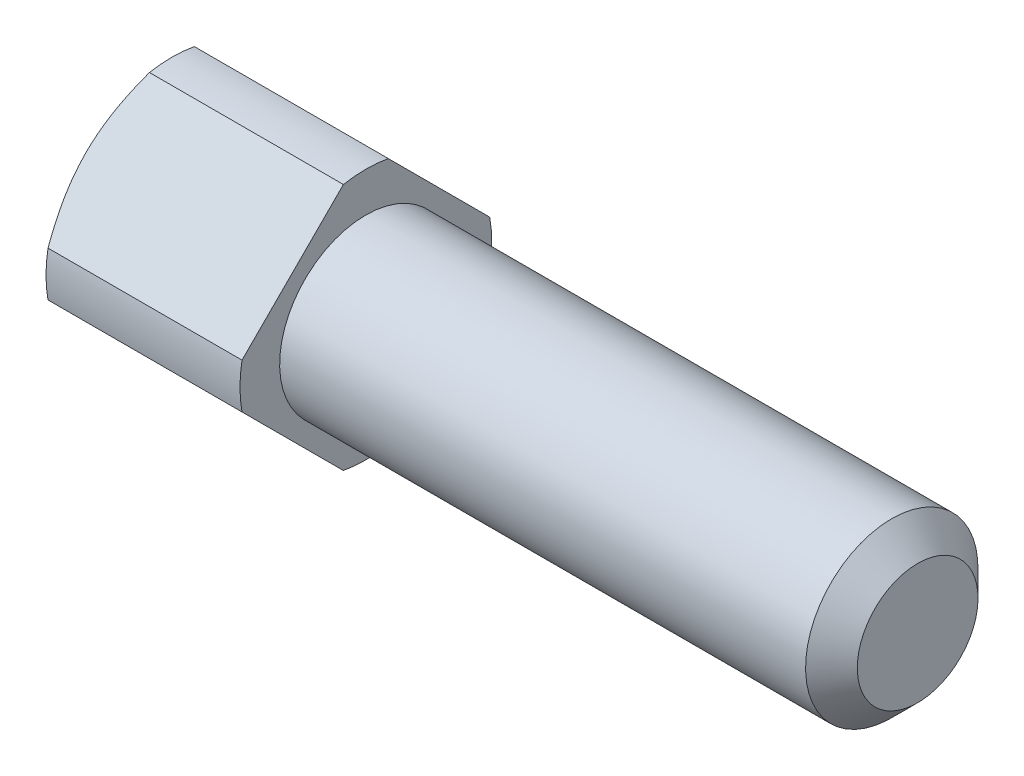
ISO-10303-21;
HEADER;
FILE_DESCRIPTION(('STEP AP214'),'2;1');
FILE_NAME('part.step','',(''),(''),'','','');
FILE_SCHEMA(('AUTOMOTIVE_DESIGN { 1 0 10303 214 1 1 1 1 }'));
ENDSEC;
DATA;
#1=APPLICATION_CONTEXT('core data for automotive mechanical design processes');
#2=APPLICATION_PROTOCOL_DEFINITION('international standard','automotive_design',2000,#1);
#3=PRODUCT_CONTEXT('',#1,'mechanical');
#4=PRODUCT('Part','Part','',(#3));
#5=PRODUCT_RELATED_PRODUCT_CATEGORY('part','',(#4));
#6=PRODUCT_DEFINITION_FORMATION('','',#4);
#7=PRODUCT_DEFINITION_CONTEXT('part definition',#1,'design');
#8=PRODUCT_DEFINITION('design','',#6,#7);
#9=PRODUCT_DEFINITION_SHAPE('','',#8);
#10=(LENGTH_UNIT() NAMED_UNIT(*) SI_UNIT(.MILLI.,.METRE.));
#11=(NAMED_UNIT(*) PLANE_ANGLE_UNIT() SI_UNIT($,.RADIAN.));
#12=(NAMED_UNIT(*) SI_UNIT($,.STERADIAN.) SOLID_ANGLE_UNIT());
#13=UNCERTAINTY_MEASURE_WITH_UNIT(LENGTH_MEASURE(1.E-05),#10,'distance_accuracy_value','');
#14=(GEOMETRIC_REPRESENTATION_CONTEXT(3) GLOBAL_UNCERTAINTY_ASSIGNED_CONTEXT((#13)) GLOBAL_UNIT_ASSIGNED_CONTEXT((#10,
#11,#12)) REPRESENTATION_CONTEXT('',''));
#15=CARTESIAN_POINT('',(0.,0.,0.));
#16=DIRECTION('',(0.,0.,1.));
#17=DIRECTION('',(1.,0.,0.));
#18=AXIS2_PLACEMENT_3D('',#15,#16,#17);
#19=CARTESIAN_POINT('',(6.,0.,0.));
#20=DIRECTION('',(1.,0.,0.));
#21=DIRECTION('',(0.,0.,-1.));
#22=AXIS2_PLACEMENT_3D('',#19,#20,#21);
#23=PLANE('',#22);
#24=CARTESIAN_POINT('',(6.,0.,0.));
#25=DIRECTION('',(1.,0.,0.));
#26=DIRECTION('',(0.,0.,-1.));
#27=AXIS2_PLACEMENT_3D('',#24,#25,#26);
#28=CIRCLE('',#27,3.65);
#29=CARTESIAN_POINT('',(6.00000000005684,0.651201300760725,3.59143938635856));
#30=VERTEX_POINT('',#29);
#31=CARTESIAN_POINT('',(6.00000000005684,-0.651201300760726,3.59143938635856));
#32=VERTEX_POINT('',#31);
#33=EDGE_CURVE('E374',#30,#32,#28,.T.);
#34=ORIENTED_EDGE('',*,*,#33,.T.);
#35=DIRECTION('',(0.,0.707106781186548,0.707106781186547));
#36=VECTOR('',#35,1.);
#37=CARTESIAN_POINT('',(6.00000000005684,-4.24264068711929,0.));
#38=LINE('',#37,#36);
#39=CARTESIAN_POINT('',(6.00000000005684,-3.59143938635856,0.651201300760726));
#40=VERTEX_POINT('',#39);
#41=EDGE_CURVE('E381',#40,#32,#38,.T.);
#42=ORIENTED_EDGE('',*,*,#41,.F.);
#43=CARTESIAN_POINT('',(6.00000000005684,-3.59143938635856,-0.651201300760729));
#44=VERTEX_POINT('',#43);
#45=EDGE_CURVE('E370',#40,#44,#28,.T.);
#46=ORIENTED_EDGE('',*,*,#45,.T.);
#47=DIRECTION('',(0.,-0.707106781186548,0.707106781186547));
#48=VECTOR('',#47,1.);
#49=CARTESIAN_POINT('',(6.00000000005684,0.,-4.24264068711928));
#50=LINE('',#49,#48);
#51=CARTESIAN_POINT('',(6.00000000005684,-0.651201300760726,-3.59143938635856));
#52=VERTEX_POINT('',#51);
#53=EDGE_CURVE('E391',#52,#44,#50,.T.);
#54=ORIENTED_EDGE('',*,*,#53,.F.);
#55=CARTESIAN_POINT('',(6.00000000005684,0.651201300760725,-3.59143938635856));
#56=VERTEX_POINT('',#55);
#57=EDGE_CURVE('E357',#52,#56,#28,.T.);
#58=ORIENTED_EDGE('',*,*,#57,.T.);
#59=DIRECTION('',(0.,-0.707106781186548,-0.707106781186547));
#60=VECTOR('',#59,1.);
#61=CARTESIAN_POINT('',(6.00000000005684,4.24264068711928,0.));
#62=LINE('',#61,#60);
#63=CARTESIAN_POINT('',(6.00000000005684,3.59143938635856,-0.651201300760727));
#64=VERTEX_POINT('',#63);
#65=EDGE_CURVE('E387',#64,#56,#62,.T.);
#66=ORIENTED_EDGE('',*,*,#65,.F.);
#67=CARTESIAN_POINT('',(6.00000000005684,3.59143938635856,0.651201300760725));
#68=VERTEX_POINT('',#67);
#69=EDGE_CURVE('E371',#64,#68,#28,.T.);
#70=ORIENTED_EDGE('',*,*,#69,.T.);
#71=DIRECTION('',(0.,0.707106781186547,-0.707106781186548));
#72=VECTOR('',#71,1.);
#73=CARTESIAN_POINT('',(6.00000000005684,0.,4.24264068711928));
#74=LINE('',#73,#72);
#75=EDGE_CURVE('E383',#30,#68,#74,.T.);
#76=ORIENTED_EDGE('',*,*,#75,.F.);
#77=EDGE_LOOP('',(#34,#42,#46,#54,#58,#66,#70,#76));
#78=FACE_BOUND('',#77,.T.);
#79=CARTESIAN_POINT('',(6.00000000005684,0.,0.));
#80=DIRECTION('',(1.,0.,0.));
#81=DIRECTION('',(0.,1.,0.));
#82=AXIS2_PLACEMENT_3D('',#79,#80,#81);
#83=CIRCLE('',#82,2.5);
#84=CARTESIAN_POINT('',(6.00000000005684,2.5,0.));
#85=VERTEX_POINT('',#84);
#86=EDGE_CURVE('E284',#85,#85,#83,.T.);
#87=ORIENTED_EDGE('',*,*,#86,.F.);
#88=EDGE_LOOP('',(#87));
#89=FACE_BOUND('',#88,.T.);
#90=ADVANCED_FACE('F38',(#78,#89),#23,.T.);
#91=CARTESIAN_POINT('',(6.,0.,0.));
#92=DIRECTION('',(-1.,0.,0.));
#93=DIRECTION('',(0.,0.,1.));
#94=AXIS2_PLACEMENT_3D('',#91,#92,#93);
#95=CYLINDRICAL_SURFACE('',#94,3.65);
#96=DIRECTION('',(-1.,0.,0.));
#97=VECTOR('',#96,1.);
#98=CARTESIAN_POINT('',(6.,0.651201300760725,3.59143938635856));
#99=LINE('',#98,#97);
#100=CARTESIAN_POINT('',(0.375277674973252,0.651201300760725,3.59143938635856));
#101=VERTEX_POINT('',#100);
#102=EDGE_CURVE('E385',#101,#30,#99,.F.);
#103=ORIENTED_EDGE('',*,*,#102,.F.);
#104=CARTESIAN_POINT('',(0.375277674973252,0.,0.));
#105=DIRECTION('',(1.,0.,0.));
#106=DIRECTION('',(0.,1.,0.));
#107=AXIS2_PLACEMENT_3D('',#104,#105,#106);
#108=CIRCLE('',#107,3.65);
#109=CARTESIAN_POINT('',(0.375277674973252,-0.651201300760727,3.59143938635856));
#110=VERTEX_POINT('',#109);
#111=EDGE_CURVE('E139',#101,#110,#108,.T.);
#112=ORIENTED_EDGE('',*,*,#111,.T.);
#113=DIRECTION('',(-1.,0.,0.));
#114=VECTOR('',#113,1.);
#115=CARTESIAN_POINT('',(6.,-0.651201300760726,3.59143938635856));
#116=LINE('',#115,#114);
#117=EDGE_CURVE('E368',#32,#110,#116,.T.);
#118=ORIENTED_EDGE('',*,*,#117,.F.);
#119=ORIENTED_EDGE('',*,*,#33,.F.);
#120=EDGE_LOOP('',(#103,#112,#118,#119));
#121=FACE_BOUND('',#120,.T.);
#122=ADVANCED_FACE('F40',(#121),#95,.T.);
#123=DIRECTION('',(-1.,0.,0.));
#124=VECTOR('',#123,1.);
#125=CARTESIAN_POINT('',(6.,-3.59143938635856,0.651201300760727));
#126=LINE('',#125,#124);
#127=CARTESIAN_POINT('',(0.375277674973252,-3.59143938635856,0.651201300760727));
#128=VERTEX_POINT('',#127);
#129=EDGE_CURVE('E361',#128,#40,#126,.F.);
#130=ORIENTED_EDGE('',*,*,#129,.F.);
#131=CARTESIAN_POINT('',(0.375277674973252,0.,0.));
#132=DIRECTION('',(1.,0.,0.));
#133=DIRECTION('',(0.,1.,0.));
#134=AXIS2_PLACEMENT_3D('',#131,#132,#133);
#135=CIRCLE('',#134,3.65);
#136=CARTESIAN_POINT('',(0.375277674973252,-3.59143938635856,-0.651201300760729));
#137=VERTEX_POINT('',#136);
#138=EDGE_CURVE('E153',#128,#137,#135,.T.);
#139=ORIENTED_EDGE('',*,*,#138,.T.);
#140=DIRECTION('',(-1.,0.,0.));
#141=VECTOR('',#140,1.);
#142=CARTESIAN_POINT('',(6.,-3.59143938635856,-0.651201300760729));
#143=LINE('',#142,#141);
#144=EDGE_CURVE('E358',#44,#137,#143,.T.);
#145=ORIENTED_EDGE('',*,*,#144,.F.);
#146=ORIENTED_EDGE('',*,*,#45,.F.);
#147=EDGE_LOOP('',(#130,#139,#145,#146));
#148=FACE_BOUND('',#147,.T.);
#149=ADVANCED_FACE('F293',(#148),#95,.T.);
#150=DIRECTION('',(-1.,0.,0.));
#151=VECTOR('',#150,1.);
#152=CARTESIAN_POINT('',(6.,-0.651201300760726,-3.59143938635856));
#153=LINE('',#152,#151);
#154=CARTESIAN_POINT('',(0.375277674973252,-0.651201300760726,-3.59143938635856));
#155=VERTEX_POINT('',#154);
#156=EDGE_CURVE('E349',#155,#52,#153,.F.);
#157=ORIENTED_EDGE('',*,*,#156,.F.);
#158=CARTESIAN_POINT('',(0.375277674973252,0.,0.));
#159=DIRECTION('',(1.,0.,0.));
#160=DIRECTION('',(0.,1.,0.));
#161=AXIS2_PLACEMENT_3D('',#158,#159,#160);
#162=CIRCLE('',#161,3.65);
#163=CARTESIAN_POINT('',(0.375277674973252,0.651201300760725,-3.59143938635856));
#164=VERTEX_POINT('',#163);
#165=EDGE_CURVE('E142',#155,#164,#162,.T.);
#166=ORIENTED_EDGE('',*,*,#165,.T.);
#167=DIRECTION('',(-1.,0.,0.));
#168=VECTOR('',#167,1.);
#169=CARTESIAN_POINT('',(6.,0.651201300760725,-3.59143938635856));
#170=LINE('',#169,#168);
#171=EDGE_CURVE('E359',#56,#164,#170,.T.);
#172=ORIENTED_EDGE('',*,*,#171,.F.);
#173=ORIENTED_EDGE('',*,*,#57,.F.);
#174=EDGE_LOOP('',(#157,#166,#172,#173));
#175=FACE_BOUND('',#174,.T.);
#176=ADVANCED_FACE('F300',(#175),#95,.T.);
#177=DIRECTION('',(-1.,0.,0.));
#178=VECTOR('',#177,1.);
#179=CARTESIAN_POINT('',(6.,3.59143938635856,-0.651201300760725));
#180=LINE('',#179,#178);
#181=CARTESIAN_POINT('',(0.375277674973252,3.59143938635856,-0.651201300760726));
#182=VERTEX_POINT('',#181);
#183=EDGE_CURVE('E363',#182,#64,#180,.F.);
#184=ORIENTED_EDGE('',*,*,#183,.F.);
#185=CARTESIAN_POINT('',(0.375277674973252,0.,0.));
#186=DIRECTION('',(1.,0.,0.));
#187=DIRECTION('',(0.,1.,0.));
#188=AXIS2_PLACEMENT_3D('',#185,#186,#187);
#189=CIRCLE('',#188,3.65);
#190=CARTESIAN_POINT('',(0.375277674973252,3.59143938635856,0.651201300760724));
#191=VERTEX_POINT('',#190);
#192=EDGE_CURVE('E149',#182,#191,#189,.T.);
#193=ORIENTED_EDGE('',*,*,#192,.T.);
#194=DIRECTION('',(-1.,0.,0.));
#195=VECTOR('',#194,1.);
#196=CARTESIAN_POINT('',(6.,3.59143938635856,0.651201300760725));
#197=LINE('',#196,#195);
#198=EDGE_CURVE('E148',#68,#191,#197,.T.);
#199=ORIENTED_EDGE('',*,*,#198,.F.);
#200=ORIENTED_EDGE('',*,*,#69,.F.);
#201=EDGE_LOOP('',(#184,#193,#199,#200));
#202=FACE_BOUND('',#201,.T.);
#203=ADVANCED_FACE('F196',(#202),#95,.T.);
#204=CARTESIAN_POINT('',(6.00000000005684,0.,4.24264068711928));
#205=DIRECTION('',(0.,0.707106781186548,0.707106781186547));
#206=DIRECTION('',(0.,-0.707106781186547,0.707106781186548));
#207=AXIS2_PLACEMENT_3D('',#204,#205,#206);
#208=PLANE('',#207);
#209=CARTESIAN_POINT('',(0.375370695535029,0.651001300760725,3.59163938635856));
#210=CARTESIAN_POINT('',(0.323268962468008,0.763120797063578,3.47951989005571));
#211=CARTESIAN_POINT('',(0.274661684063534,0.876174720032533,3.36646596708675));
#212=CARTESIAN_POINT('',(0.186909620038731,1.10452820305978,3.13811248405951));
#213=CARTESIAN_POINT('',(0.147799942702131,1.21983444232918,3.0228062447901));
#214=CARTESIAN_POINT('',(0.0829033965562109,1.44883414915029,2.79380653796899));
#215=CARTESIAN_POINT('',(0.0567585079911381,1.56247530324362,2.68016538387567));
#216=CARTESIAN_POINT('',(0.0185374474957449,1.79078192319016,2.45185876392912));
#217=CARTESIAN_POINT('',(0.00643659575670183,1.90544523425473,2.33719545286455));
#218=CARTESIAN_POINT('',(-0.000588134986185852,2.08579182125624,2.15684886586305));
#219=CARTESIAN_POINT('',(-0.00065299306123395,2.15139124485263,2.09124944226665));
#220=CARTESIAN_POINT('',(0.00417098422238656,2.28250476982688,1.9601359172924));
#221=CARTESIAN_POINT('',(0.00906003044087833,2.34801886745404,1.89462181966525));
#222=CARTESIAN_POINT('',(0.0236362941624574,2.4789109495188,1.76372973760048));
#223=CARTESIAN_POINT('',(0.0333332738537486,2.54428838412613,1.69835230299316));
#224=CARTESIAN_POINT('',(0.0571990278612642,2.67463782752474,1.56800285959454));
#225=CARTESIAN_POINT('',(0.0713685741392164,2.73960976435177,1.50303092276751));
#226=CARTESIAN_POINT('',(0.121061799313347,2.93818256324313,1.30445812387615));
#227=CARTESIAN_POINT('',(0.1632291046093,3.07096692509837,1.17167376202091));
#228=CARTESIAN_POINT('',(0.2362538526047,3.26794686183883,0.974693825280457));
#229=CARTESIAN_POINT('',(0.262163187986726,3.3331132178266,0.909527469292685));
#230=CARTESIAN_POINT('',(0.316779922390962,3.46282259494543,0.779818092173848));
#231=CARTESIAN_POINT('',(0.345485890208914,3.52736591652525,0.715274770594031));
#232=CARTESIAN_POINT('',(0.375370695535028,3.59163938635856,0.651001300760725));
#233=B_SPLINE_CURVE_WITH_KNOTS('',3,(#209,#210,#211,#212,#213,#214,#215,#216,#217,#218,#219,
#220,#221,#222,#223,#224,#225,#226,#227,#228,#229,#230,#231,#232),.UNSPECIFIED.,.F.,.F.,(4,2,2,
2,2,2,2,2,2,2,2,4),(0.,0.500916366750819,1.0036571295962,1.49161120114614,1.97870647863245,
2.25690162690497,2.53510861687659,2.81388281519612,3.09270515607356,3.66932423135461,
3.95649300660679,4.24351558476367),.UNSPECIFIED.);
#234=CARTESIAN_POINT('',(0.,2.12132034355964,2.12132034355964));
#235=VERTEX_POINT('',#234);
#236=EDGE_CURVE('E135',#101,#235,#233,.T.);
#237=ORIENTED_EDGE('',*,*,#236,.F.);
#238=ORIENTED_EDGE('',*,*,#102,.T.);
#239=ORIENTED_EDGE('',*,*,#75,.T.);
#240=ORIENTED_EDGE('',*,*,#198,.T.);
#241=EDGE_CURVE('E123',#235,#191,#233,.T.);
#242=ORIENTED_EDGE('',*,*,#241,.F.);
#243=EDGE_LOOP('',(#237,#238,#239,#240,#242));
#244=FACE_BOUND('',#243,.T.);
#245=ADVANCED_FACE('F146',(#244),#208,.T.);
#246=CARTESIAN_POINT('',(6.00000000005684,4.24264068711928,0.));
#247=DIRECTION('',(0.,0.707106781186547,-0.707106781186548));
#248=DIRECTION('',(0.,0.707106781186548,0.707106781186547));
#249=AXIS2_PLACEMENT_3D('',#246,#247,#248);
#250=PLANE('',#249);
#251=CARTESIAN_POINT('',(0.375370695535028,3.59163938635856,-0.651001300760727));
#252=CARTESIAN_POINT('',(0.323268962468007,3.4795198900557,-0.76312079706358));
#253=CARTESIAN_POINT('',(0.274661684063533,3.36646596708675,-0.876174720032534));
#254=CARTESIAN_POINT('',(0.18690962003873,3.13811248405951,-1.10452820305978));
#255=CARTESIAN_POINT('',(0.14779994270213,3.0228062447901,-1.21983444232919));
#256=CARTESIAN_POINT('',(0.0829033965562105,2.79380653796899,-1.44883414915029));
#257=CARTESIAN_POINT('',(0.0567585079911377,2.68016538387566,-1.56247530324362));
#258=CARTESIAN_POINT('',(0.0185374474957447,2.45185876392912,-1.79078192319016));
#259=CARTESIAN_POINT('',(0.00643659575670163,2.33719545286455,-1.90544523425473));
#260=CARTESIAN_POINT('',(-0.000588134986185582,2.15684886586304,-2.08579182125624));
#261=CARTESIAN_POINT('',(-0.000652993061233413,2.09124944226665,-2.15139124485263));
#262=CARTESIAN_POINT('',(0.00417098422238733,1.9601359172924,-2.28250476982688));
#263=CARTESIAN_POINT('',(0.00906003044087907,1.89462181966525,-2.34801886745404));
#264=CARTESIAN_POINT('',(0.0236362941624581,1.76372973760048,-2.4789109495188));
#265=CARTESIAN_POINT('',(0.0333332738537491,1.69835230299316,-2.54428838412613));
#266=CARTESIAN_POINT('',(0.0571990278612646,1.56800285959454,-2.67463782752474));
#267=CARTESIAN_POINT('',(0.0713685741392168,1.50303092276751,-2.73960976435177));
#268=CARTESIAN_POINT('',(0.121061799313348,1.30445812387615,-2.93818256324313));
#269=CARTESIAN_POINT('',(0.163229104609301,1.17167376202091,-3.07096692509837));
#270=CARTESIAN_POINT('',(0.2362538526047,0.974693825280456,-3.26794686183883));
#271=CARTESIAN_POINT('',(0.262163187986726,0.909527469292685,-3.3331132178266));
#272=CARTESIAN_POINT('',(0.316779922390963,0.779818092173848,-3.46282259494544));
#273=CARTESIAN_POINT('',(0.345485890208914,0.715274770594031,-3.52736591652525));
#274=CARTESIAN_POINT('',(0.375370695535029,0.651001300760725,-3.59163938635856));
#275=B_SPLINE_CURVE_WITH_KNOTS('',3,(#251,#252,#253,#254,#255,#256,#257,#258,#259,#260,#261,
#262,#263,#264,#265,#266,#267,#268,#269,#270,#271,#272,#273,#274),.UNSPECIFIED.,.F.,.F.,(4,2,2,
2,2,2,2,2,2,2,2,4),(0.,0.500916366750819,1.0036571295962,1.49161120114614,1.97870647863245,
2.25690162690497,2.53510861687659,2.81388281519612,3.09270515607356,3.66932423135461,
3.95649300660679,4.24351558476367),.UNSPECIFIED.);
#276=CARTESIAN_POINT('',(0.,2.12132034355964,-2.12132034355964));
#277=VERTEX_POINT('',#276);
#278=EDGE_CURVE('E126',#182,#277,#275,.T.);
#279=ORIENTED_EDGE('',*,*,#278,.F.);
#280=ORIENTED_EDGE('',*,*,#183,.T.);
#281=ORIENTED_EDGE('',*,*,#65,.T.);
#282=ORIENTED_EDGE('',*,*,#171,.T.);
#283=EDGE_CURVE('E184',#277,#164,#275,.T.);
#284=ORIENTED_EDGE('',*,*,#283,.F.);
#285=EDGE_LOOP('',(#279,#280,#281,#282,#284));
#286=FACE_BOUND('',#285,.T.);
#287=ADVANCED_FACE('F190',(#286),#250,.T.);
#288=CARTESIAN_POINT('',(6.00000000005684,0.,-4.24264068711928));
#289=DIRECTION('',(0.,-0.707106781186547,-0.707106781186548));
#290=DIRECTION('',(0.,0.707106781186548,-0.707106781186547));
#291=AXIS2_PLACEMENT_3D('',#288,#289,#290);
#292=PLANE('',#291);
#293=CARTESIAN_POINT('',(0.375370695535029,-0.651001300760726,-3.59163938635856));
#294=CARTESIAN_POINT('',(0.323268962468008,-0.763120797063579,-3.47951989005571));
#295=CARTESIAN_POINT('',(0.274661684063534,-0.876174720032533,-3.36646596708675));
#296=CARTESIAN_POINT('',(0.186909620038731,-1.10452820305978,-3.13811248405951));
#297=CARTESIAN_POINT('',(0.147799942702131,-1.21983444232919,-3.0228062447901));
#298=CARTESIAN_POINT('',(0.0829033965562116,-1.44883414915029,-2.79380653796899));
#299=CARTESIAN_POINT('',(0.0567585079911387,-1.56247530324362,-2.68016538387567));
#300=CARTESIAN_POINT('',(0.0185374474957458,-1.79078192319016,-2.45185876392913));
#301=CARTESIAN_POINT('',(0.00643659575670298,-1.90544523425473,-2.33719545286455));
#302=CARTESIAN_POINT('',(-0.000588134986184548,-2.08579182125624,-2.15684886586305));
#303=CARTESIAN_POINT('',(-0.000652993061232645,-2.15139124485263,-2.09124944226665));
#304=CARTESIAN_POINT('',(0.00417098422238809,-2.28250476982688,-1.9601359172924));
#305=CARTESIAN_POINT('',(0.00906003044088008,-2.34801886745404,-1.89462181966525));
#306=CARTESIAN_POINT('',(0.0236362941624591,-2.4789109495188,-1.76372973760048));
#307=CARTESIAN_POINT('',(0.03333327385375,-2.54428838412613,-1.69835230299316));
#308=CARTESIAN_POINT('',(0.0571990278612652,-2.67463782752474,-1.56800285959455));
#309=CARTESIAN_POINT('',(0.0713685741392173,-2.73960976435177,-1.50303092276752));
#310=CARTESIAN_POINT('',(0.121061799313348,-2.93818256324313,-1.30445812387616));
#311=CARTESIAN_POINT('',(0.163229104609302,-3.07096692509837,-1.17167376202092));
#312=CARTESIAN_POINT('',(0.236253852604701,-3.26794686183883,-0.974693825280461));
#313=CARTESIAN_POINT('',(0.262163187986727,-3.3331132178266,-0.90952746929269));
#314=CARTESIAN_POINT('',(0.316779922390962,-3.46282259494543,-0.779818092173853));
#315=CARTESIAN_POINT('',(0.345485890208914,-3.52736591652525,-0.715274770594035));
#316=CARTESIAN_POINT('',(0.375370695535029,-3.59163938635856,-0.651001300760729));
#317=B_SPLINE_CURVE_WITH_KNOTS('',3,(#293,#294,#295,#296,#297,#298,#299,#300,#301,#302,#303,
#304,#305,#306,#307,#308,#309,#310,#311,#312,#313,#314,#315,#316),.UNSPECIFIED.,.F.,.F.,(4,2,2,
2,2,2,2,2,2,2,2,4),(0.,0.500916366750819,1.0036571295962,1.49161120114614,1.97870647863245,
2.25690162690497,2.53510861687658,2.81388281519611,3.09270515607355,3.66932423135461,
3.95649300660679,4.24351558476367),.UNSPECIFIED.);
#318=CARTESIAN_POINT('',(0.,-2.12132034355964,-2.12132034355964));
#319=VERTEX_POINT('',#318);
#320=EDGE_CURVE('E143',#155,#319,#317,.T.);
#321=ORIENTED_EDGE('',*,*,#320,.F.);
#322=ORIENTED_EDGE('',*,*,#156,.T.);
#323=ORIENTED_EDGE('',*,*,#53,.T.);
#324=ORIENTED_EDGE('',*,*,#144,.T.);
#325=EDGE_CURVE('E160',#319,#137,#317,.T.);
#326=ORIENTED_EDGE('',*,*,#325,.F.);
#327=EDGE_LOOP('',(#321,#322,#323,#324,#326));
#328=FACE_BOUND('',#327,.T.);
#329=ADVANCED_FACE('F170',(#328),#292,.T.);
#330=CARTESIAN_POINT('',(6.00000000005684,-4.24264068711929,0.));
#331=DIRECTION('',(0.,-0.707106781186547,0.707106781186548));
#332=DIRECTION('',(0.,-0.707106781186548,-0.707106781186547));
#333=AXIS2_PLACEMENT_3D('',#330,#331,#332);
#334=PLANE('',#333);
#335=CARTESIAN_POINT('',(0.37537069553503,-3.59163938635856,0.651001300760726));
#336=CARTESIAN_POINT('',(0.323268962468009,-3.47951989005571,0.763120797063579));
#337=CARTESIAN_POINT('',(0.274661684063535,-3.36646596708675,0.876174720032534));
#338=CARTESIAN_POINT('',(0.186909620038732,-3.13811248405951,1.10452820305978));
#339=CARTESIAN_POINT('',(0.147799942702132,-3.0228062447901,1.21983444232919));
#340=CARTESIAN_POINT('',(0.0829033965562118,-2.79380653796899,1.44883414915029));
#341=CARTESIAN_POINT('',(0.056758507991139,-2.68016538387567,1.56247530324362));
#342=CARTESIAN_POINT('',(0.018537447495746,-2.45185876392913,1.79078192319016));
#343=CARTESIAN_POINT('',(0.00643659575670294,-2.33719545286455,1.90544523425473));
#344=CARTESIAN_POINT('',(-0.000588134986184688,-2.15684886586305,2.08579182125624));
#345=CARTESIAN_POINT('',(-0.000652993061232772,-2.09124944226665,2.15139124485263));
#346=CARTESIAN_POINT('',(0.00417098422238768,-1.9601359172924,2.28250476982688));
#347=CARTESIAN_POINT('',(0.0090600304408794,-1.89462181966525,2.34801886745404));
#348=CARTESIAN_POINT('',(0.0236362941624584,-1.76372973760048,2.4789109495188));
#349=CARTESIAN_POINT('',(0.0333332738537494,-1.69835230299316,2.54428838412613));
#350=CARTESIAN_POINT('',(0.0571990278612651,-1.56800285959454,2.67463782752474));
#351=CARTESIAN_POINT('',(0.0713685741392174,-1.50303092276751,2.73960976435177));
#352=CARTESIAN_POINT('',(0.121061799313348,-1.30445812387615,2.93818256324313));
#353=CARTESIAN_POINT('',(0.163229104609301,-1.17167376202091,3.07096692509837));
#354=CARTESIAN_POINT('',(0.236253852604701,-0.974693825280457,3.26794686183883));
#355=CARTESIAN_POINT('',(0.262163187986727,-0.909527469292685,3.3331132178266));
#356=CARTESIAN_POINT('',(0.316779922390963,-0.779818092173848,3.46282259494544));
#357=CARTESIAN_POINT('',(0.345485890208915,-0.715274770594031,3.52736591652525));
#358=CARTESIAN_POINT('',(0.375370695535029,-0.651001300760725,3.59163938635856));
#359=B_SPLINE_CURVE_WITH_KNOTS('',3,(#335,#336,#337,#338,#339,#340,#341,#342,#343,#344,#345,
#346,#347,#348,#349,#350,#351,#352,#353,#354,#355,#356,#357,#358),.UNSPECIFIED.,.F.,.F.,(4,2,2,
2,2,2,2,2,2,2,2,4),(0.,0.500916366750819,1.0036571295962,1.49161120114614,1.97870647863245,
2.25690162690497,2.53510861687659,2.81388281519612,3.09270515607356,3.66932423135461,
3.95649300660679,4.24351558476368),.UNSPECIFIED.);
#360=CARTESIAN_POINT('',(0.,-2.12132034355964,2.12132034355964));
#361=VERTEX_POINT('',#360);
#362=EDGE_CURVE('E12',#128,#361,#359,.T.);
#363=ORIENTED_EDGE('',*,*,#362,.F.);
#364=ORIENTED_EDGE('',*,*,#129,.T.);
#365=ORIENTED_EDGE('',*,*,#41,.T.);
#366=ORIENTED_EDGE('',*,*,#117,.T.);
#367=EDGE_CURVE('E42',#361,#110,#359,.T.);
#368=ORIENTED_EDGE('',*,*,#367,.F.);
#369=EDGE_LOOP('',(#363,#364,#365,#366,#368));
#370=FACE_BOUND('',#369,.T.);
#371=ADVANCED_FACE('F197',(#370),#334,.T.);
#372=CARTESIAN_POINT('',(0.,0.,0.));
#373=DIRECTION('',(1.,0.,0.));
#374=DIRECTION('',(0.,1.,0.));
#375=AXIS2_PLACEMENT_3D('',#372,#373,#374);
#376=CONICAL_SURFACE('',#375,3.,1.0471975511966);
#377=ORIENTED_EDGE('',*,*,#236,.T.);
#378=CARTESIAN_POINT('',(0.,0.,0.));
#379=DIRECTION('',(1.,0.,0.));
#380=DIRECTION('',(0.,1.,0.));
#381=AXIS2_PLACEMENT_3D('',#378,#379,#380);
#382=CIRCLE('',#381,3.);
#383=EDGE_CURVE('E132',#235,#361,#382,.T.);
#384=ORIENTED_EDGE('',*,*,#383,.T.);
#385=ORIENTED_EDGE('',*,*,#367,.T.);
#386=ORIENTED_EDGE('',*,*,#111,.F.);
#387=EDGE_LOOP('',(#377,#384,#385,#386));
#388=FACE_BOUND('',#387,.T.);
#389=ADVANCED_FACE('F136',(#388),#376,.T.);
#390=ORIENTED_EDGE('',*,*,#325,.T.);
#391=ORIENTED_EDGE('',*,*,#138,.F.);
#392=ORIENTED_EDGE('',*,*,#362,.T.);
#393=EDGE_CURVE('E152',#361,#319,#382,.T.);
#394=ORIENTED_EDGE('',*,*,#393,.T.);
#395=EDGE_LOOP('',(#390,#391,#392,#394));
#396=FACE_BOUND('',#395,.T.);
#397=ADVANCED_FACE('F173',(#396),#376,.T.);
#398=ORIENTED_EDGE('',*,*,#283,.T.);
#399=ORIENTED_EDGE('',*,*,#165,.F.);
#400=ORIENTED_EDGE('',*,*,#320,.T.);
#401=EDGE_CURVE('E58',#319,#277,#382,.T.);
#402=ORIENTED_EDGE('',*,*,#401,.T.);
#403=EDGE_LOOP('',(#398,#399,#400,#402));
#404=FACE_BOUND('',#403,.T.);
#405=ADVANCED_FACE('F177',(#404),#376,.T.);
#406=ORIENTED_EDGE('',*,*,#278,.T.);
#407=EDGE_CURVE('E119',#277,#235,#382,.T.);
#408=ORIENTED_EDGE('',*,*,#407,.T.);
#409=ORIENTED_EDGE('',*,*,#241,.T.);
#410=ORIENTED_EDGE('',*,*,#192,.F.);
#411=EDGE_LOOP('',(#406,#408,#409,#410));
#412=FACE_BOUND('',#411,.T.);
#413=ADVANCED_FACE('F121',(#412),#376,.T.);
#414=CARTESIAN_POINT('',(0.,0.,0.));
#415=DIRECTION('',(1.,0.,0.));
#416=DIRECTION('',(0.,0.,-1.));
#417=AXIS2_PLACEMENT_3D('',#414,#415,#416);
#418=PLANE('',#417);
#419=ORIENTED_EDGE('',*,*,#401,.F.);
#420=ORIENTED_EDGE('',*,*,#393,.F.);
#421=ORIENTED_EDGE('',*,*,#383,.F.);
#422=ORIENTED_EDGE('',*,*,#407,.F.);
#423=EDGE_LOOP('',(#419,#420,#421,#422));
#424=FACE_BOUND('',#423,.T.);
#425=ADVANCED_FACE('F151',(#424),#418,.F.);
#426=CARTESIAN_POINT('',(22.0000000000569,-1.75,0.));
#427=DIRECTION('',(-1.,0.,0.));
#428=DIRECTION('',(0.,-1.,0.));
#429=AXIS2_PLACEMENT_3D('',#426,#427,#428);
#430=PLANE('',#429);
#431=CARTESIAN_POINT('',(22.0000000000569,0.,0.));
#432=DIRECTION('',(1.,0.,0.));
#433=DIRECTION('',(0.,1.,0.));
#434=AXIS2_PLACEMENT_3D('',#431,#432,#433);
#435=CIRCLE('',#434,1.75);
#436=CARTESIAN_POINT('',(22.0000000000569,1.75,0.));
#437=VERTEX_POINT('',#436);
#438=EDGE_CURVE('E130',#437,#437,#435,.T.);
#439=ORIENTED_EDGE('',*,*,#438,.T.);
#440=EDGE_LOOP('',(#439));
#441=FACE_BOUND('',#440,.T.);
#442=ADVANCED_FACE('F178',(#441),#430,.F.);
#443=CARTESIAN_POINT('',(21.2500000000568,0.,0.));
#444=DIRECTION('',(-1.,0.,0.));
#445=DIRECTION('',(0.,-1.,0.));
#446=AXIS2_PLACEMENT_3D('',#443,#444,#445);
#447=CONICAL_SURFACE('',#446,2.5,0.785398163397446);
#448=ORIENTED_EDGE('',*,*,#438,.F.);
#449=EDGE_LOOP('',(#448));
#450=FACE_BOUND('',#449,.T.);
#451=CARTESIAN_POINT('',(21.2500000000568,0.,0.));
#452=DIRECTION('',(1.,0.,0.));
#453=DIRECTION('',(0.,1.,0.));
#454=AXIS2_PLACEMENT_3D('',#451,#452,#453);
#455=CIRCLE('',#454,2.5);
#456=CARTESIAN_POINT('',(21.2500000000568,2.50000000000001,0.));
#457=VERTEX_POINT('',#456);
#458=EDGE_CURVE('E281',#457,#457,#455,.T.);
#459=ORIENTED_EDGE('',*,*,#458,.T.);
#460=EDGE_LOOP('',(#459));
#461=FACE_BOUND('',#460,.T.);
#462=ADVANCED_FACE('F209',(#450,#461),#447,.T.);
#463=CARTESIAN_POINT('',(14.0868030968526,0.,0.));
#464=DIRECTION('',(1.,0.,0.));
#465=DIRECTION('',(0.,1.,0.));
#466=AXIS2_PLACEMENT_3D('',#463,#464,#465);
#467=CYLINDRICAL_SURFACE('',#466,2.5);
#468=ORIENTED_EDGE('',*,*,#458,.F.);
#469=EDGE_LOOP('',(#468));
#470=FACE_BOUND('',#469,.T.);
#471=ORIENTED_EDGE('',*,*,#86,.T.);
#472=EDGE_LOOP('',(#471));
#473=FACE_BOUND('',#472,.T.);
#474=ADVANCED_FACE('F261',(#470,#473),#467,.T.);
#475=CLOSED_SHELL('',(#90,#122,#149,#176,#203,#245,#287,#329,#371,#389,#397,#405,#413,#425,#442,
#462,#474));
#476=MANIFOLD_SOLID_BREP('B2',#475);
#477=ADVANCED_BREP_SHAPE_REPRESENTATION('',(#18,#476),#14);
#478=SHAPE_DEFINITION_REPRESENTATION(#9,#477);
ENDSEC;
END-ISO-10303-21;
